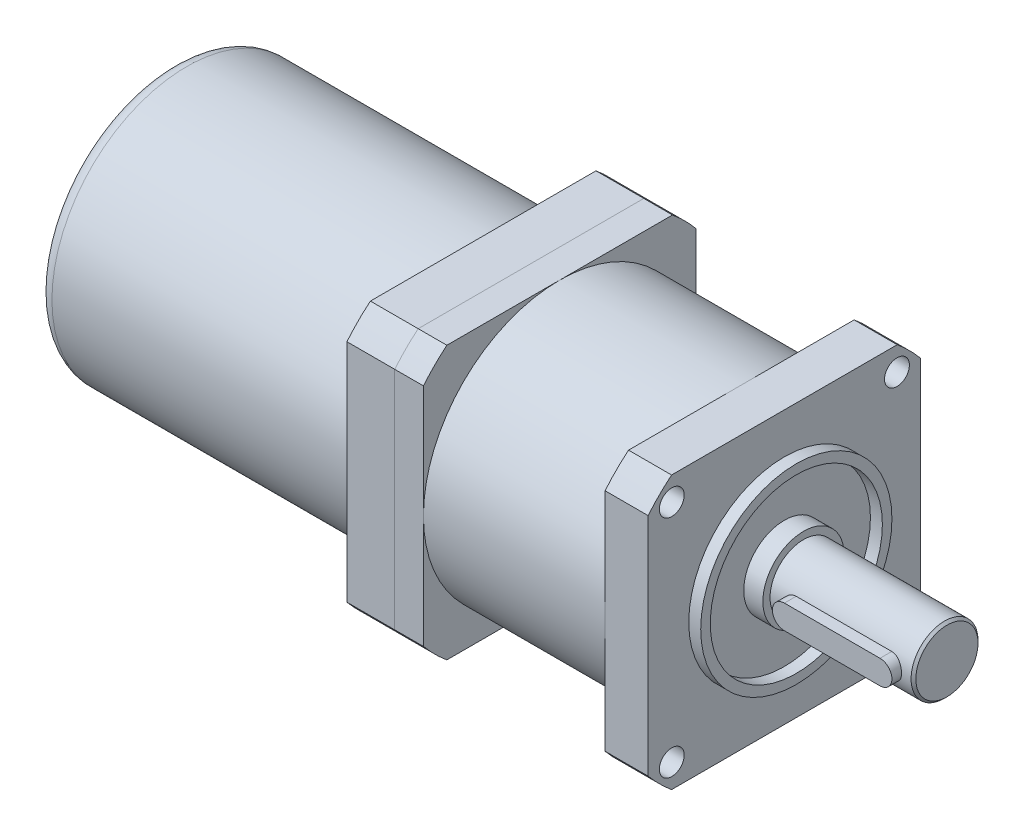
from build123d import *

# Parameters (mm, degrees)
EXTRUDE_1_DEPTH     = 9
SKETCH_2_R          = 28.5
EXTRUDE_2_DEPTH     = 38
EXTRUDE_3_DEPTH     = 6
SKETCH_6_R          = 2.6
CUT_EXTRUDE_2_DEPTH = 9
SKETCH_7_R          = 20
SKETCH_7_R_2        = 18
EXTRUDE_5_DEPTH     = 2.5
SKETCH_8_R          = 8.5
EXTRUDE_6_DEPTH     = 4
SKETCH_9_R          = 7
EXTRUDE_7_DEPTH     = 30
CUT_EXTRUDE_3_DEPTH = 3
EXTRUDE_START       = 5
EXTRUDE_8_DEPTH     = 5
CHAMFER_1_SIZE      = 0.5
EXTRUDE_9_DEPTH     = 10
SKETCH_15_R         = 28.2
EXTRUDE_10_DEPTH    = 65
FILLET_1_R          = 3


with BuildPart() as part:
    # Sketch 1 → Extrude 1 (new body)
    with BuildSketch(Plane(origin=(0, 0, 0), x_dir=(0, 0, -1), z_dir=(1, 0, 0))):
        with BuildLine():
            Line((-23.595550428, -28.5), (23.595550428, -28.5))
            ThreePointArc((23.595550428, -28.5), (26.162950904, -26.162950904), (28.5, -23.595550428))
            Line((28.5, -23.595550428), (28.5, 23.595550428))
            ThreePointArc((28.5, 23.595550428), (26.162950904, 26.162950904), (23.595550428, 28.5))
            Line((23.595550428, 28.5), (-23.595550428, 28.5))
            ThreePointArc((-23.595550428, 28.5), (-26.162950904, 26.162950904), (-28.5, 23.595550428))
            Line((-28.5, 23.595550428), (-28.5, -23.595550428))
            ThreePointArc((-28.5, -23.595550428), (-26.162950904, -26.162950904), (-23.595550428, -28.5))
        make_face()
    extrude(amount=-EXTRUDE_1_DEPTH)

    # Sketch 2 → Extrude 2 (add)
    with BuildSketch(Plane.ZY.offset(9)):
        Circle(SKETCH_2_R)
    extrude(amount=EXTRUDE_2_DEPTH)

    # Sketch 3 → Extrude 3 (add)
    with BuildSketch(Plane.ZY.offset(47)):
        with BuildLine():
            Line((-23.595550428, -28.5), (23.595550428, -28.5))
            ThreePointArc((23.595550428, -28.5), (26.162950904, -26.162950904), (28.5, -23.595550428))
            Line((28.5, -23.595550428), (28.5, 23.595550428))
            ThreePointArc((28.5, 23.595550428), (26.162950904, 26.162950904), (23.595550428, 28.5))
            Line((23.595550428, 28.5), (-23.595550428, 28.5))
            ThreePointArc((-23.595550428, 28.5), (-26.162950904, 26.162950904), (-28.5, 23.595550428))
            Line((-28.5, 23.595550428), (-28.5, -23.595550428))
            ThreePointArc((-28.5, -23.595550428), (-26.162950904, -26.162950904), (-23.595550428, -28.5))
        make_face()
    extrude(amount=EXTRUDE_3_DEPTH)

    # Sketch 6 → Cut-Extrude 2 (cut)
    with BuildSketch(Plane(origin=(0, 0, 0), x_dir=(0, 0, -1), z_dir=(1, 0, 0))):
        with Locations((-23.55, 23.55)):
            Circle(SKETCH_6_R)
        with Locations((23.55, 23.55)):
            Circle(SKETCH_6_R)
        with Locations((23.55, -23.55)):
            Circle(SKETCH_6_R)
        with Locations((-23.55, -23.55)):
            Circle(SKETCH_6_R)
    extrude(amount=-CUT_EXTRUDE_2_DEPTH, mode=Mode.SUBTRACT)

    # Sketch 7 → Extrude 5 (add)
    with BuildSketch(Plane(origin=(0, 0, 0), x_dir=(0, 0, -1), z_dir=(1, 0, 0))):
        Circle(SKETCH_7_R)
        Circle(SKETCH_7_R_2, mode=Mode.SUBTRACT)
    extrude(amount=EXTRUDE_5_DEPTH)

    # Sketch 8 → Extrude 6 (add)
    with BuildSketch(Plane(origin=(0, 0, 0), x_dir=(0, 0, -1), z_dir=(1, 0, 0))):
        Circle(SKETCH_8_R)
    extrude(amount=EXTRUDE_6_DEPTH)

    # Sketch 9 → Extrude 7 (add)
    with BuildSketch(Plane(origin=(4, 0, 0), x_dir=(0, 0, -1), z_dir=(1, 0, 0))):
        Circle(SKETCH_9_R)
    extrude(amount=EXTRUDE_7_DEPTH)

    # Sketch 10 → Cut-Extrude 3 (cut)
    with BuildSketch(Plane.XY.offset(7)):
        with BuildLine():
            Line((9, 2.5), (29, 2.5))
            ThreePointArc((29, 2.5), (31.5, 0), (29, -2.5))
            Line((29, -2.5), (9, -2.5))
            ThreePointArc((9, -2.5), (6.5, 0), (9, 2.5))
        make_face()
    extrude(amount=-CUT_EXTRUDE_3_DEPTH, mode=Mode.SUBTRACT)

    # Sketch 11 → Extrude 8 (add)
    with BuildSketch(Plane.XY.offset(4).offset(EXTRUDE_START)):
        with BuildLine():
            Line((9, 2.5), (29, 2.5))
            ThreePointArc((29, 2.5), (31.5, 0), (29, -2.5))
            Line((29, -2.5), (9, -2.5))
            ThreePointArc((9, -2.5), (6.5, 0), (9, 2.5))
        make_face()
    extrude(amount=-EXTRUDE_8_DEPTH)

    # Chamfer 1
    chamfer_1_edges = [part.edges().sort_by_distance(p)[0] for p in [
        (34, 0, 7),
    ]]
    chamfer(chamfer_1_edges, length=CHAMFER_1_SIZE)


with BuildPart() as body_2:
    # Sketch 14 → Extrude 9 (new body)
    with BuildSketch(Plane.ZY.offset(53)):
        with BuildLine():
            Line((-23.595550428, -28.5), (23.595550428, -28.5))
            ThreePointArc((23.595550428, -28.5), (26.162950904, -26.162950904), (28.5, -23.595550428))
            Line((28.5, -23.595550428), (28.5, 23.595550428))
            ThreePointArc((28.5, 23.595550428), (26.162950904, 26.162950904), (23.595550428, 28.5))
            Line((23.595550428, 28.5), (-23.595550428, 28.5))
            ThreePointArc((-23.595550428, 28.5), (-26.162950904, 26.162950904), (-28.5, 23.595550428))
            Line((-28.5, 23.595550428), (-28.5, -23.595550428))
            ThreePointArc((-28.5, -23.595550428), (-26.162950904, -26.162950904), (-23.595550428, -28.5))
        make_face()
    extrude(amount=EXTRUDE_9_DEPTH)

    # Sketch 15 → Extrude 10 (add)
    with BuildSketch(Plane.ZY.offset(63)):
        Circle(SKETCH_15_R)
    extrude(amount=EXTRUDE_10_DEPTH)

    # Fillet 1
    fillet_1_edges = [body_2.edges().sort_by_distance(p)[0] for p in [
        (-128, 0, -28.2),
    ]]
    fillet(fillet_1_edges, radius=FILLET_1_R)


solid = Compound([part.part, body_2.part])
